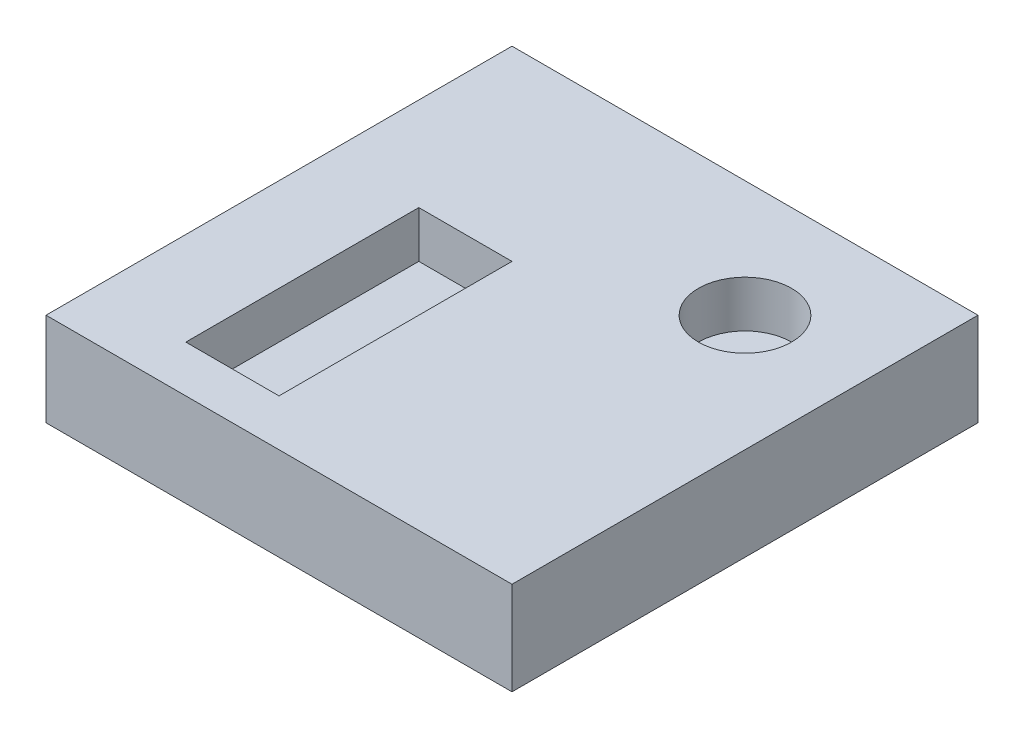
ISO-10303-21;
HEADER;
FILE_DESCRIPTION(('STEP AP214'),'2;1');
FILE_NAME('part.step','',(''),(''),'','','');
FILE_SCHEMA(('AUTOMOTIVE_DESIGN { 1 0 10303 214 1 1 1 1 }'));
ENDSEC;
DATA;
#1=APPLICATION_CONTEXT('core data for automotive mechanical design processes');
#2=APPLICATION_PROTOCOL_DEFINITION('international standard','automotive_design',2000,#1);
#3=PRODUCT_CONTEXT('',#1,'mechanical');
#4=PRODUCT('Part','Part','',(#3));
#5=PRODUCT_RELATED_PRODUCT_CATEGORY('part','',(#4));
#6=PRODUCT_DEFINITION_FORMATION('','',#4);
#7=PRODUCT_DEFINITION_CONTEXT('part definition',#1,'design');
#8=PRODUCT_DEFINITION('design','',#6,#7);
#9=PRODUCT_DEFINITION_SHAPE('','',#8);
#10=(LENGTH_UNIT() NAMED_UNIT(*) SI_UNIT(.MILLI.,.METRE.));
#11=(NAMED_UNIT(*) PLANE_ANGLE_UNIT() SI_UNIT($,.RADIAN.));
#12=(NAMED_UNIT(*) SI_UNIT($,.STERADIAN.) SOLID_ANGLE_UNIT());
#13=UNCERTAINTY_MEASURE_WITH_UNIT(LENGTH_MEASURE(1.E-05),#10,'distance_accuracy_value','');
#14=(GEOMETRIC_REPRESENTATION_CONTEXT(3) GLOBAL_UNCERTAINTY_ASSIGNED_CONTEXT((#13)) GLOBAL_UNIT_ASSIGNED_CONTEXT((#10,
#11,#12)) REPRESENTATION_CONTEXT('',''));
#15=CARTESIAN_POINT('',(0.,0.,0.));
#16=DIRECTION('',(0.,0.,1.));
#17=DIRECTION('',(1.,0.,0.));
#18=AXIS2_PLACEMENT_3D('',#15,#16,#17);
#19=CARTESIAN_POINT('',(0.,20.,0.));
#20=DIRECTION('',(-1.,0.,0.));
#21=DIRECTION('',(0.,0.,1.));
#22=AXIS2_PLACEMENT_3D('',#19,#20,#21);
#23=PLANE('',#22);
#24=DIRECTION('',(0.,0.,-1.));
#25=VECTOR('',#24,1.);
#26=CARTESIAN_POINT('',(0.,0.,0.));
#27=LINE('',#26,#25);
#28=CARTESIAN_POINT('',(0.,0.,0.));
#29=VERTEX_POINT('',#28);
#30=CARTESIAN_POINT('',(0.,0.,-100.));
#31=VERTEX_POINT('',#30);
#32=EDGE_CURVE('E146',#29,#31,#27,.T.);
#33=ORIENTED_EDGE('',*,*,#32,.T.);
#34=DIRECTION('',(0.,-1.,0.));
#35=VECTOR('',#34,1.);
#36=CARTESIAN_POINT('',(0.,20.,-100.));
#37=LINE('',#36,#35);
#38=CARTESIAN_POINT('',(0.,20.,-100.));
#39=VERTEX_POINT('',#38);
#40=EDGE_CURVE('E11',#39,#31,#37,.T.);
#41=ORIENTED_EDGE('',*,*,#40,.F.);
#42=DIRECTION('',(0.,0.,-1.));
#43=VECTOR('',#42,1.);
#44=CARTESIAN_POINT('',(0.,20.,0.));
#45=LINE('',#44,#43);
#46=CARTESIAN_POINT('',(0.,20.,0.));
#47=VERTEX_POINT('',#46);
#48=EDGE_CURVE('E150',#47,#39,#45,.T.);
#49=ORIENTED_EDGE('',*,*,#48,.F.);
#50=DIRECTION('',(0.,-1.,0.));
#51=VECTOR('',#50,1.);
#52=CARTESIAN_POINT('',(0.,20.,0.));
#53=LINE('',#52,#51);
#54=EDGE_CURVE('E156',#47,#29,#53,.T.);
#55=ORIENTED_EDGE('',*,*,#54,.T.);
#56=EDGE_LOOP('',(#33,#41,#49,#55));
#57=FACE_BOUND('',#56,.T.);
#58=ADVANCED_FACE('F34',(#57),#23,.F.);
#59=CARTESIAN_POINT('',(0.,20.,-100.));
#60=DIRECTION('',(0.,0.,1.));
#61=DIRECTION('',(1.,0.,0.));
#62=AXIS2_PLACEMENT_3D('',#59,#60,#61);
#63=PLANE('',#62);
#64=DIRECTION('',(-1.,0.,0.));
#65=VECTOR('',#64,1.);
#66=CARTESIAN_POINT('',(0.,0.,-100.));
#67=LINE('',#66,#65);
#68=CARTESIAN_POINT('',(-100.,0.,-100.));
#69=VERTEX_POINT('',#68);
#70=EDGE_CURVE('E159',#31,#69,#67,.T.);
#71=ORIENTED_EDGE('',*,*,#70,.T.);
#72=DIRECTION('',(0.,-1.,0.));
#73=VECTOR('',#72,1.);
#74=CARTESIAN_POINT('',(-100.,20.,-100.));
#75=LINE('',#74,#73);
#76=CARTESIAN_POINT('',(-100.,20.,-100.));
#77=VERTEX_POINT('',#76);
#78=EDGE_CURVE('E41',#77,#69,#75,.T.);
#79=ORIENTED_EDGE('',*,*,#78,.F.);
#80=DIRECTION('',(-1.,0.,0.));
#81=VECTOR('',#80,1.);
#82=CARTESIAN_POINT('',(0.,20.,-100.));
#83=LINE('',#82,#81);
#84=EDGE_CURVE('E85',#39,#77,#83,.T.);
#85=ORIENTED_EDGE('',*,*,#84,.F.);
#86=ORIENTED_EDGE('',*,*,#40,.T.);
#87=EDGE_LOOP('',(#71,#79,#85,#86));
#88=FACE_BOUND('',#87,.T.);
#89=ADVANCED_FACE('F188',(#88),#63,.F.);
#90=CARTESIAN_POINT('',(-100.,20.,0.));
#91=DIRECTION('',(1.,0.,0.));
#92=DIRECTION('',(0.,0.,-1.));
#93=AXIS2_PLACEMENT_3D('',#90,#91,#92);
#94=PLANE('',#93);
#95=DIRECTION('',(0.,0.,1.));
#96=VECTOR('',#95,1.);
#97=CARTESIAN_POINT('',(-100.,0.,0.));
#98=LINE('',#97,#96);
#99=CARTESIAN_POINT('',(-100.,0.,0.));
#100=VERTEX_POINT('',#99);
#101=EDGE_CURVE('E161',#69,#100,#98,.T.);
#102=ORIENTED_EDGE('',*,*,#101,.T.);
#103=DIRECTION('',(0.,-1.,0.));
#104=VECTOR('',#103,1.);
#105=CARTESIAN_POINT('',(-100.,20.,0.));
#106=LINE('',#105,#104);
#107=CARTESIAN_POINT('',(-100.,20.,0.));
#108=VERTEX_POINT('',#107);
#109=EDGE_CURVE('E165',#108,#100,#106,.T.);
#110=ORIENTED_EDGE('',*,*,#109,.F.);
#111=DIRECTION('',(0.,0.,1.));
#112=VECTOR('',#111,1.);
#113=CARTESIAN_POINT('',(-100.,20.,0.));
#114=LINE('',#113,#112);
#115=EDGE_CURVE('E153',#77,#108,#114,.T.);
#116=ORIENTED_EDGE('',*,*,#115,.F.);
#117=ORIENTED_EDGE('',*,*,#78,.T.);
#118=EDGE_LOOP('',(#102,#110,#116,#117));
#119=FACE_BOUND('',#118,.T.);
#120=ADVANCED_FACE('F170',(#119),#94,.F.);
#121=CARTESIAN_POINT('',(0.,20.,0.));
#122=DIRECTION('',(0.,0.,-1.));
#123=DIRECTION('',(-1.,0.,0.));
#124=AXIS2_PLACEMENT_3D('',#121,#122,#123);
#125=PLANE('',#124);
#126=DIRECTION('',(1.,0.,0.));
#127=VECTOR('',#126,1.);
#128=CARTESIAN_POINT('',(0.,0.,0.));
#129=LINE('',#128,#127);
#130=EDGE_CURVE('E78',#100,#29,#129,.T.);
#131=ORIENTED_EDGE('',*,*,#130,.T.);
#132=ORIENTED_EDGE('',*,*,#54,.F.);
#133=DIRECTION('',(1.,0.,0.));
#134=VECTOR('',#133,1.);
#135=CARTESIAN_POINT('',(0.,20.,0.));
#136=LINE('',#135,#134);
#137=EDGE_CURVE('E57',#108,#47,#136,.T.);
#138=ORIENTED_EDGE('',*,*,#137,.F.);
#139=ORIENTED_EDGE('',*,*,#109,.T.);
#140=EDGE_LOOP('',(#131,#132,#138,#139));
#141=FACE_BOUND('',#140,.T.);
#142=ADVANCED_FACE('F178',(#141),#125,.F.);
#143=CARTESIAN_POINT('',(0.,20.,0.));
#144=DIRECTION('',(0.,1.,0.));
#145=DIRECTION('',(0.,0.,1.));
#146=AXIS2_PLACEMENT_3D('',#143,#144,#145);
#147=PLANE('',#146);
#148=CARTESIAN_POINT('',(-25.,20.,-75.));
#149=DIRECTION('',(0.,1.,0.));
#150=DIRECTION('',(0.,0.,1.));
#151=AXIS2_PLACEMENT_3D('',#148,#149,#150);
#152=CIRCLE('',#151,10.);
#153=CARTESIAN_POINT('',(-25.,20.,-65.));
#154=VERTEX_POINT('',#153);
#155=EDGE_CURVE('E133',#154,#154,#152,.T.);
#156=ORIENTED_EDGE('',*,*,#155,.F.);
#157=EDGE_LOOP('',(#156));
#158=FACE_BOUND('',#157,.T.);
#159=DIRECTION('',(0.,0.,1.));
#160=VECTOR('',#159,1.);
#161=CARTESIAN_POINT('',(-80.,20.,-60.));
#162=LINE('',#161,#160);
#163=CARTESIAN_POINT('',(-80.,20.,-60.));
#164=VERTEX_POINT('',#163);
#165=CARTESIAN_POINT('',(-80.,20.,-9.99999999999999));
#166=VERTEX_POINT('',#165);
#167=EDGE_CURVE('E48',#164,#166,#162,.T.);
#168=ORIENTED_EDGE('',*,*,#167,.F.);
#169=DIRECTION('',(-1.,0.,0.));
#170=VECTOR('',#169,1.);
#171=CARTESIAN_POINT('',(-80.,20.,-60.));
#172=LINE('',#171,#170);
#173=CARTESIAN_POINT('',(-60.,20.,-60.));
#174=VERTEX_POINT('',#173);
#175=EDGE_CURVE('E127',#174,#164,#172,.T.);
#176=ORIENTED_EDGE('',*,*,#175,.F.);
#177=DIRECTION('',(0.,0.,-1.));
#178=VECTOR('',#177,1.);
#179=CARTESIAN_POINT('',(-60.,20.,-60.));
#180=LINE('',#179,#178);
#181=CARTESIAN_POINT('',(-60.,20.,-9.99999999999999));
#182=VERTEX_POINT('',#181);
#183=EDGE_CURVE('E130',#182,#174,#180,.T.);
#184=ORIENTED_EDGE('',*,*,#183,.F.);
#185=DIRECTION('',(1.,0.,0.));
#186=VECTOR('',#185,1.);
#187=CARTESIAN_POINT('',(-80.,20.,-9.99999999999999));
#188=LINE('',#187,#186);
#189=EDGE_CURVE('E139',#166,#182,#188,.T.);
#190=ORIENTED_EDGE('',*,*,#189,.F.);
#191=EDGE_LOOP('',(#168,#176,#184,#190));
#192=FACE_BOUND('',#191,.T.);
#193=ORIENTED_EDGE('',*,*,#48,.T.);
#194=ORIENTED_EDGE('',*,*,#84,.T.);
#195=ORIENTED_EDGE('',*,*,#115,.T.);
#196=ORIENTED_EDGE('',*,*,#137,.T.);
#197=EDGE_LOOP('',(#193,#194,#195,#196));
#198=FACE_BOUND('',#197,.T.);
#199=ADVANCED_FACE('F180',(#158,#192,#198),#147,.T.);
#200=CARTESIAN_POINT('',(0.,0.,0.));
#201=DIRECTION('',(0.,1.,0.));
#202=DIRECTION('',(0.,0.,1.));
#203=AXIS2_PLACEMENT_3D('',#200,#201,#202);
#204=PLANE('',#203);
#205=ORIENTED_EDGE('',*,*,#32,.F.);
#206=ORIENTED_EDGE('',*,*,#130,.F.);
#207=ORIENTED_EDGE('',*,*,#101,.F.);
#208=ORIENTED_EDGE('',*,*,#70,.F.);
#209=EDGE_LOOP('',(#205,#206,#207,#208));
#210=FACE_BOUND('',#209,.T.);
#211=ADVANCED_FACE('F174',(#210),#204,.F.);
#212=CARTESIAN_POINT('',(-80.,10.,-60.));
#213=DIRECTION('',(-1.,0.,0.));
#214=DIRECTION('',(0.,0.,1.));
#215=AXIS2_PLACEMENT_3D('',#212,#213,#214);
#216=PLANE('',#215);
#217=ORIENTED_EDGE('',*,*,#167,.T.);
#218=DIRECTION('',(0.,1.,0.));
#219=VECTOR('',#218,1.);
#220=CARTESIAN_POINT('',(-80.,10.,-9.99999999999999));
#221=LINE('',#220,#219);
#222=CARTESIAN_POINT('',(-80.,10.,-9.99999999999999));
#223=VERTEX_POINT('',#222);
#224=EDGE_CURVE('E105',#223,#166,#221,.T.);
#225=ORIENTED_EDGE('',*,*,#224,.F.);
#226=DIRECTION('',(0.,0.,1.));
#227=VECTOR('',#226,1.);
#228=CARTESIAN_POINT('',(-80.,10.,-60.));
#229=LINE('',#228,#227);
#230=CARTESIAN_POINT('',(-80.,10.,-60.));
#231=VERTEX_POINT('',#230);
#232=EDGE_CURVE('E109',#231,#223,#229,.T.);
#233=ORIENTED_EDGE('',*,*,#232,.F.);
#234=DIRECTION('',(0.,1.,0.));
#235=VECTOR('',#234,1.);
#236=CARTESIAN_POINT('',(-80.,10.,-60.));
#237=LINE('',#236,#235);
#238=EDGE_CURVE('E144',#231,#164,#237,.T.);
#239=ORIENTED_EDGE('',*,*,#238,.T.);
#240=EDGE_LOOP('',(#217,#225,#233,#239));
#241=FACE_BOUND('',#240,.T.);
#242=ADVANCED_FACE('F107',(#241),#216,.F.);
#243=CARTESIAN_POINT('',(-80.,10.,-60.));
#244=DIRECTION('',(0.,0.,-1.));
#245=DIRECTION('',(-1.,0.,0.));
#246=AXIS2_PLACEMENT_3D('',#243,#244,#245);
#247=PLANE('',#246);
#248=ORIENTED_EDGE('',*,*,#175,.T.);
#249=ORIENTED_EDGE('',*,*,#238,.F.);
#250=DIRECTION('',(-1.,0.,0.));
#251=VECTOR('',#250,1.);
#252=CARTESIAN_POINT('',(-80.,10.,-60.));
#253=LINE('',#252,#251);
#254=CARTESIAN_POINT('',(-60.,10.,-60.));
#255=VERTEX_POINT('',#254);
#256=EDGE_CURVE('E115',#255,#231,#253,.T.);
#257=ORIENTED_EDGE('',*,*,#256,.F.);
#258=DIRECTION('',(0.,1.,0.));
#259=VECTOR('',#258,1.);
#260=CARTESIAN_POINT('',(-60.,10.,-60.));
#261=LINE('',#260,#259);
#262=EDGE_CURVE('E147',#255,#174,#261,.T.);
#263=ORIENTED_EDGE('',*,*,#262,.T.);
#264=EDGE_LOOP('',(#248,#249,#257,#263));
#265=FACE_BOUND('',#264,.T.);
#266=ADVANCED_FACE('F222',(#265),#247,.F.);
#267=CARTESIAN_POINT('',(-60.,10.,-60.));
#268=DIRECTION('',(1.,0.,0.));
#269=DIRECTION('',(0.,0.,-1.));
#270=AXIS2_PLACEMENT_3D('',#267,#268,#269);
#271=PLANE('',#270);
#272=ORIENTED_EDGE('',*,*,#183,.T.);
#273=ORIENTED_EDGE('',*,*,#262,.F.);
#274=DIRECTION('',(0.,0.,-1.));
#275=VECTOR('',#274,1.);
#276=CARTESIAN_POINT('',(-60.,10.,-60.));
#277=LINE('',#276,#275);
#278=CARTESIAN_POINT('',(-60.,10.,-9.99999999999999));
#279=VERTEX_POINT('',#278);
#280=EDGE_CURVE('E123',#279,#255,#277,.T.);
#281=ORIENTED_EDGE('',*,*,#280,.F.);
#282=DIRECTION('',(0.,1.,0.));
#283=VECTOR('',#282,1.);
#284=CARTESIAN_POINT('',(-60.,10.,-9.99999999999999));
#285=LINE('',#284,#283);
#286=EDGE_CURVE('E114',#279,#182,#285,.T.);
#287=ORIENTED_EDGE('',*,*,#286,.T.);
#288=EDGE_LOOP('',(#272,#273,#281,#287));
#289=FACE_BOUND('',#288,.T.);
#290=ADVANCED_FACE('F231',(#289),#271,.F.);
#291=CARTESIAN_POINT('',(-80.,10.,-9.99999999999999));
#292=DIRECTION('',(0.,0.,1.));
#293=DIRECTION('',(1.,0.,0.));
#294=AXIS2_PLACEMENT_3D('',#291,#292,#293);
#295=PLANE('',#294);
#296=ORIENTED_EDGE('',*,*,#189,.T.);
#297=ORIENTED_EDGE('',*,*,#286,.F.);
#298=DIRECTION('',(1.,0.,0.));
#299=VECTOR('',#298,1.);
#300=CARTESIAN_POINT('',(-80.,10.,-9.99999999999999));
#301=LINE('',#300,#299);
#302=EDGE_CURVE('E118',#223,#279,#301,.T.);
#303=ORIENTED_EDGE('',*,*,#302,.F.);
#304=ORIENTED_EDGE('',*,*,#224,.T.);
#305=EDGE_LOOP('',(#296,#297,#303,#304));
#306=FACE_BOUND('',#305,.T.);
#307=ADVANCED_FACE('F119',(#306),#295,.F.);
#308=CARTESIAN_POINT('',(0.,10.,0.));
#309=DIRECTION('',(0.,1.,0.));
#310=DIRECTION('',(0.,0.,1.));
#311=AXIS2_PLACEMENT_3D('',#308,#309,#310);
#312=PLANE('',#311);
#313=ORIENTED_EDGE('',*,*,#232,.T.);
#314=ORIENTED_EDGE('',*,*,#302,.T.);
#315=ORIENTED_EDGE('',*,*,#280,.T.);
#316=ORIENTED_EDGE('',*,*,#256,.T.);
#317=EDGE_LOOP('',(#313,#314,#315,#316));
#318=FACE_BOUND('',#317,.T.);
#319=ADVANCED_FACE('F125',(#318),#312,.T.);
#320=CARTESIAN_POINT('',(-25.,10.,-75.));
#321=DIRECTION('',(0.,1.,0.));
#322=DIRECTION('',(0.,0.,1.));
#323=AXIS2_PLACEMENT_3D('',#320,#321,#322);
#324=CYLINDRICAL_SURFACE('',#323,10.);
#325=CARTESIAN_POINT('',(-25.,10.,-75.));
#326=DIRECTION('',(0.,1.,0.));
#327=DIRECTION('',(0.,0.,1.));
#328=AXIS2_PLACEMENT_3D('',#325,#326,#327);
#329=CIRCLE('',#328,10.);
#330=CARTESIAN_POINT('',(-25.,10.,-65.));
#331=VERTEX_POINT('',#330);
#332=EDGE_CURVE('E140',#331,#331,#329,.T.);
#333=ORIENTED_EDGE('',*,*,#332,.F.);
#334=EDGE_LOOP('',(#333));
#335=FACE_BOUND('',#334,.T.);
#336=ORIENTED_EDGE('',*,*,#155,.T.);
#337=EDGE_LOOP('',(#336));
#338=FACE_BOUND('',#337,.T.);
#339=ADVANCED_FACE('F258',(#335,#338),#324,.F.);
#340=CARTESIAN_POINT('',(-25.,10.,-75.));
#341=DIRECTION('',(0.,1.,0.));
#342=DIRECTION('',(0.,0.,1.));
#343=AXIS2_PLACEMENT_3D('',#340,#341,#342);
#344=PLANE('',#343);
#345=ORIENTED_EDGE('',*,*,#332,.T.);
#346=EDGE_LOOP('',(#345));
#347=FACE_BOUND('',#346,.T.);
#348=ADVANCED_FACE('F272',(#347),#344,.T.);
#349=CLOSED_SHELL('',(#58,#89,#120,#142,#199,#211,#242,#266,#290,#307,#319,#339,#348));
#350=MANIFOLD_SOLID_BREP('B2',#349);
#351=ADVANCED_BREP_SHAPE_REPRESENTATION('',(#18,#350),#14);
#352=SHAPE_DEFINITION_REPRESENTATION(#9,#351);
ENDSEC;
END-ISO-10303-21;
